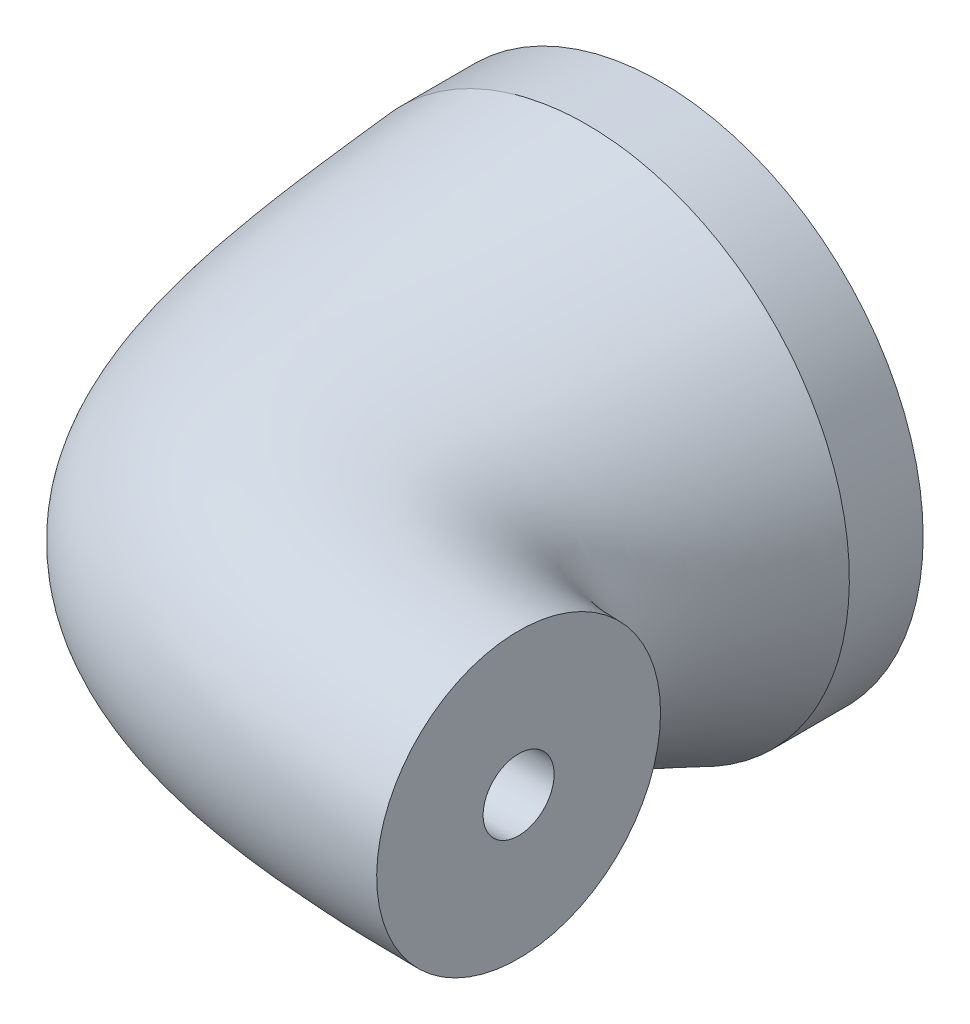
ISO-10303-21;
HEADER;
FILE_DESCRIPTION(('STEP AP214'),'2;1');
FILE_NAME('part.step','',(''),(''),'','','');
FILE_SCHEMA(('AUTOMOTIVE_DESIGN { 1 0 10303 214 1 1 1 1 }'));
ENDSEC;
DATA;
#1=APPLICATION_CONTEXT('core data for automotive mechanical design processes');
#2=APPLICATION_PROTOCOL_DEFINITION('international standard','automotive_design',2000,#1);
#3=PRODUCT_CONTEXT('',#1,'mechanical');
#4=PRODUCT('Part','Part','',(#3));
#5=PRODUCT_RELATED_PRODUCT_CATEGORY('part','',(#4));
#6=PRODUCT_DEFINITION_FORMATION('','',#4);
#7=PRODUCT_DEFINITION_CONTEXT('part definition',#1,'design');
#8=PRODUCT_DEFINITION('design','',#6,#7);
#9=PRODUCT_DEFINITION_SHAPE('','',#8);
#10=(LENGTH_UNIT() NAMED_UNIT(*) SI_UNIT(.MILLI.,.METRE.));
#11=(NAMED_UNIT(*) PLANE_ANGLE_UNIT() SI_UNIT($,.RADIAN.));
#12=(NAMED_UNIT(*) SI_UNIT($,.STERADIAN.) SOLID_ANGLE_UNIT());
#13=UNCERTAINTY_MEASURE_WITH_UNIT(LENGTH_MEASURE(1.E-05),#10,'distance_accuracy_value','');
#14=(GEOMETRIC_REPRESENTATION_CONTEXT(3) GLOBAL_UNCERTAINTY_ASSIGNED_CONTEXT((#13)) GLOBAL_UNIT_ASSIGNED_CONTEXT((#10,
#11,#12)) REPRESENTATION_CONTEXT('',''));
#15=CARTESIAN_POINT('',(0.,0.,0.));
#16=DIRECTION('',(0.,0.,1.));
#17=DIRECTION('',(1.,0.,0.));
#18=AXIS2_PLACEMENT_3D('',#15,#16,#17);
#19=CARTESIAN_POINT('',(0.,0.,0.));
#20=DIRECTION('',(0.,0.,1.));
#21=DIRECTION('',(1.,0.,0.));
#22=AXIS2_PLACEMENT_3D('',#19,#20,#21);
#23=PLANE('',#22);
#24=CARTESIAN_POINT('',(0.,0.,0.));
#25=DIRECTION('',(0.,0.,1.));
#26=DIRECTION('',(1.,0.,0.));
#27=AXIS2_PLACEMENT_3D('',#24,#25,#26);
#28=CIRCLE('',#27,185.);
#29=CARTESIAN_POINT('',(185.,0.,0.));
#30=VERTEX_POINT('',#29);
#31=EDGE_CURVE('E11',#30,#30,#28,.T.);
#32=ORIENTED_EDGE('',*,*,#31,.F.);
#33=EDGE_LOOP('',(#32));
#34=FACE_BOUND('',#33,.T.);
#35=CARTESIAN_POINT('',(0.,0.,0.));
#36=DIRECTION('',(0.,0.,1.));
#37=DIRECTION('',(1.,0.,0.));
#38=AXIS2_PLACEMENT_3D('',#35,#36,#37);
#39=CIRCLE('',#38,166.);
#40=CARTESIAN_POINT('',(166.,0.,0.));
#41=VERTEX_POINT('',#40);
#42=EDGE_CURVE('E78',#41,#41,#39,.T.);
#43=ORIENTED_EDGE('',*,*,#42,.T.);
#44=EDGE_LOOP('',(#43));
#45=FACE_BOUND('',#44,.T.);
#46=ADVANCED_FACE('F67',(#34,#45),#23,.F.);
#47=CARTESIAN_POINT('',(0.,0.,50.));
#48=DIRECTION('',(0.,0.,-1.));
#49=DIRECTION('',(-1.,0.,0.));
#50=AXIS2_PLACEMENT_3D('',#47,#48,#49);
#51=CYLINDRICAL_SURFACE('',#50,185.);
#52=ORIENTED_EDGE('',*,*,#31,.T.);
#53=EDGE_LOOP('',(#52));
#54=FACE_BOUND('',#53,.T.);
#55=CARTESIAN_POINT('',(-184.889341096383,6.39777687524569,52.));
#56=CARTESIAN_POINT('',(-185.308074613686,-5.70320220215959,52.));
#57=CARTESIAN_POINT('',(-183.762540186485,-29.9876200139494,51.9999999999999));
#58=CARTESIAN_POINT('',(-174.380959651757,-65.2615224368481,52.0000000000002));
#59=CARTESIAN_POINT('',(-158.298533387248,-98.0275061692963,51.9999999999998));
#60=CARTESIAN_POINT('',(-136.13258113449,-127.026475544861,52.0000000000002));
#61=CARTESIAN_POINT('',(-108.735244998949,-151.143824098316,51.9999999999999));
#62=CARTESIAN_POINT('',(-77.159208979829,-169.452841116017,52.0000000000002));
#63=CARTESIAN_POINT('',(-42.6180230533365,-181.249860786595,51.9999999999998));
#64=CARTESIAN_POINT('',(-6.43902823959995,-186.081563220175,52.));
#65=CARTESIAN_POINT('',(29.9874001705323,-183.762247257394,52.));
#66=CARTESIAN_POINT('',(65.2614424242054,-174.381059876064,52.));
#67=CARTESIAN_POINT('',(98.0275048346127,-158.298497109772,51.9999999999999));
#68=CARTESIAN_POINT('',(127.026453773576,-136.132631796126,52.0000000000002));
#69=CARTESIAN_POINT('',(151.143791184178,-108.735240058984,51.9999999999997));
#70=CARTESIAN_POINT('',(169.452887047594,-77.1592671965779,52.0000000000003));
#71=CARTESIAN_POINT('',(181.249830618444,-42.6180078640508,51.9999999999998));
#72=CARTESIAN_POINT('',(186.081580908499,-6.43903227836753,51.9999999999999));
#73=CARTESIAN_POINT('',(183.762215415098,29.9873953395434,52.0000000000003));
#74=CARTESIAN_POINT('',(174.38111160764,65.261484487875,51.9999999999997));
#75=CARTESIAN_POINT('',(158.298460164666,98.02752446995,52.0000000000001));
#76=CARTESIAN_POINT('',(136.13262062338,127.026465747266,52.));
#77=CARTESIAN_POINT('',(108.735223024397,151.143829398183,52.));
#78=CARTESIAN_POINT('',(77.1592216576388,169.452838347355,52.));
#79=CARTESIAN_POINT('',(42.6180148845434,181.24986205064,52.));
#80=CARTESIAN_POINT('',(6.43903508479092,186.08156298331,52.));
#81=CARTESIAN_POINT('',(-29.9874084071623,183.762246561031,52.));
#82=CARTESIAN_POINT('',(-65.2614295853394,174.381061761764,52.));
#83=CARTESIAN_POINT('',(-98.0275271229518,158.298493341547,52.));
#84=CARTESIAN_POINT('',(-127.026413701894,136.132638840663,52.));
#85=CARTESIAN_POINT('',(-151.143865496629,108.735226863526,51.9999999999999));
#86=CARTESIAN_POINT('',(-169.452732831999,77.1592945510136,52.0000000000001));
#87=CARTESIAN_POINT('',(-181.250139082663,42.6182544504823,51.9999999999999));
#88=CARTESIAN_POINT('',(-184.470607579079,18.498755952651,52.));
#89=CARTESIAN_POINT('',(-184.889341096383,6.39777687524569,52.));
#90=B_SPLINE_CURVE_WITH_KNOTS('',3,(#55,#56,#57,#58,#59,#60,#61,#62,#63,#64,#65,#66,#67,#68,#69,
#70,#71,#72,#73,#74,#75,#76,#77,#78,#79,#80,#81,#82,#83,#84,#85,#86,#87,#88,#89),.UNSPECIFIED.,
.T.,.F.,(4,1,1,1,1,1,1,1,1,1,1,1,1,1,1,1,1,1,1,1,1,1,1,1,1,1,1,1,1,1,1,1,4),(0.,0.03125,0.0625,
0.09375,0.125,0.15625,0.1875,0.21875,0.25,0.28125,0.3125,0.34375,0.375,0.40625,0.4375,0.46875,
0.5,0.53125,0.5625,0.59375,0.625,0.65625,0.6875,0.71875,0.75,0.78125,0.8125,0.84375,0.875,
0.90625,0.9375,0.96875,1.),.UNSPECIFIED.);
#91=CARTESIAN_POINT('',(-184.889341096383,6.39777687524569,52.));
#92=VERTEX_POINT('',#91);
#93=EDGE_CURVE('E90',#92,#92,#90,.T.);
#94=ORIENTED_EDGE('',*,*,#93,.F.);
#95=EDGE_LOOP('',(#94));
#96=FACE_BOUND('',#95,.T.);
#97=ADVANCED_FACE('F69',(#54,#96),#51,.T.);
#98=CARTESIAN_POINT('',(0.,0.,50.));
#99=DIRECTION('',(0.,0.,-1.));
#100=DIRECTION('',(-1.,0.,0.));
#101=AXIS2_PLACEMENT_3D('',#98,#99,#100);
#102=CYLINDRICAL_SURFACE('',#101,166.);
#103=CARTESIAN_POINT('',(0.,0.,50.));
#104=DIRECTION('',(0.,0.,1.));
#105=DIRECTION('',(1.,0.,0.));
#106=AXIS2_PLACEMENT_3D('',#103,#104,#105);
#107=CIRCLE('',#106,166.);
#108=CARTESIAN_POINT('',(166.,0.,50.));
#109=VERTEX_POINT('',#108);
#110=EDGE_CURVE('E84',#109,#109,#107,.T.);
#111=ORIENTED_EDGE('',*,*,#110,.T.);
#112=EDGE_LOOP('',(#111));
#113=FACE_BOUND('',#112,.T.);
#114=ORIENTED_EDGE('',*,*,#42,.F.);
#115=EDGE_LOOP('',(#114));
#116=FACE_BOUND('',#115,.T.);
#117=ADVANCED_FACE('F173',(#113,#116),#102,.F.);
#118=CARTESIAN_POINT('',(0.,0.,50.));
#119=DIRECTION('',(0.,0.,1.));
#120=DIRECTION('',(1.,0.,0.));
#121=AXIS2_PLACEMENT_3D('',#118,#119,#120);
#122=PLANE('',#121);
#123=ORIENTED_EDGE('',*,*,#110,.F.);
#124=EDGE_LOOP('',(#123));
#125=FACE_BOUND('',#124,.T.);
#126=ADVANCED_FACE('F129',(#125),#122,.F.);
#127=CARTESIAN_POINT('',(-184.889341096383,6.39777687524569,52.));
#128=CARTESIAN_POINT('',(-186.210499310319,8.92705380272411,225.670797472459));
#129=CARTESIAN_POINT('',(-187.531657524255,11.4563307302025,399.341594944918));
#130=CARTESIAN_POINT('',(200.,11.4563307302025,399.341594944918));
#131=CARTESIAN_POINT('',(-185.308074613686,-5.70320220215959,52.));
#132=CARTESIAN_POINT('',(-186.706652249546,-0.374381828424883,226.045705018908));
#133=CARTESIAN_POINT('',(-188.105229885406,4.95443854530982,400.091410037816));
#134=CARTESIAN_POINT('',(200.,4.95443854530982,400.091410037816));
#135=CARTESIAN_POINT('',(-183.762540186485,-29.9876200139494,51.9999999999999));
#136=CARTESIAN_POINT('',(-185.49901874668,-19.0923105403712,226.155336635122));
#137=CARTESIAN_POINT('',(-187.235497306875,-8.19700106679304,400.310673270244));
#138=CARTESIAN_POINT('',(200.,-8.19700106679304,400.310673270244));
#139=CARTESIAN_POINT('',(-174.380959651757,-65.2615224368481,52.0000000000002));
#140=CARTESIAN_POINT('',(-177.151254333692,-46.4352652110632,224.391911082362));
#141=CARTESIAN_POINT('',(-179.921549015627,-27.6090079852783,396.783822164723));
#142=CARTESIAN_POINT('',(200.,-27.6090079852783,396.783822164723));
#143=CARTESIAN_POINT('',(-158.298533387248,-98.0275061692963,51.9999999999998));
#144=CARTESIAN_POINT('',(-162.590753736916,-71.9937866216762,220.769022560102));
#145=CARTESIAN_POINT('',(-166.882974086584,-45.9600670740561,389.538045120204));
#146=CARTESIAN_POINT('',(200.,-45.9600670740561,389.538045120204));
#147=CARTESIAN_POINT('',(-136.13258113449,-127.026475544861,52.0000000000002));
#148=CARTESIAN_POINT('',(-142.377866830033,-94.7857256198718,215.425575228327));
#149=CARTESIAN_POINT('',(-148.623152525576,-62.5449756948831,378.851150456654));
#150=CARTESIAN_POINT('',(200.,-62.5449756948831,378.851150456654));
#151=CARTESIAN_POINT('',(-108.735244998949,-151.143824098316,51.9999999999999));
#152=CARTESIAN_POINT('',(-117.293654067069,-113.935061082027,208.567082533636));
#153=CARTESIAN_POINT('',(-125.852063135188,-76.7262980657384,365.134165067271));
#154=CARTESIAN_POINT('',(200.,-76.7262980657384,365.134165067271));
#155=CARTESIAN_POINT('',(-77.159208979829,-169.452841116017,52.0000000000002));
#156=CARTESIAN_POINT('',(-88.3083877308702,-128.705949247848,200.457019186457));
#157=CARTESIAN_POINT('',(-99.4575664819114,-87.9590573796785,348.914038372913));
#158=CARTESIAN_POINT('',(200.,-87.9590573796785,348.914038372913));
#159=CARTESIAN_POINT('',(-42.6180230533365,-181.249860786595,51.9999999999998));
#160=CARTESIAN_POINT('',(-56.5455798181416,-138.530751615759,191.407095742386));
#161=CARTESIAN_POINT('',(-70.4731365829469,-95.8116424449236,330.814191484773));
#162=CARTESIAN_POINT('',(199.999999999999,-95.8116424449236,330.814191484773));
#163=CARTESIAN_POINT('',(-6.43902823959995,-186.081563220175,52.));
#164=CARTESIAN_POINT('',(-23.2389966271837,-143.031866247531,181.765100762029));
#165=CARTESIAN_POINT('',(-40.0389650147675,-99.9821692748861,311.530201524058));
#166=CARTESIAN_POINT('',(200.000000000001,-99.9821692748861,311.530201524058));
#167=CARTESIAN_POINT('',(29.9874001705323,-183.762247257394,52.));
#168=CARTESIAN_POINT('',(10.3140574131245,-142.036373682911,171.901564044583));
#169=CARTESIAN_POINT('',(-9.35928534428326,-100.310500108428,291.803128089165));
#170=CARTESIAN_POINT('',(199.999999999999,-100.310500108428,291.803128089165));
#171=CARTESIAN_POINT('',(65.2614424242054,-174.381059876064,52.));
#172=CARTESIAN_POINT('',(42.8027491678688,-135.582476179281,162.195494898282));
#173=CARTESIAN_POINT('',(20.3440559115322,-96.7838924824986,272.390989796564));
#174=CARTESIAN_POINT('',(200.000000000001,-96.7838924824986,272.390989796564));
#175=CARTESIAN_POINT('',(98.0275048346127,-158.298497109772,51.9999999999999));
#176=CARTESIAN_POINT('',(72.9545909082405,-123.918240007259,153.019939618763));
#177=CARTESIAN_POINT('',(47.8816769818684,-89.5379829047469,254.039879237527));
#178=CARTESIAN_POINT('',(199.999999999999,-89.5379829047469,254.039879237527));
#179=CARTESIAN_POINT('',(127.026453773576,-136.132631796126,52.0000000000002));
#180=CARTESIAN_POINT('',(99.5894823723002,-107.491886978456,144.727494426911));
#181=CARTESIAN_POINT('',(72.1525109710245,-78.8511421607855,237.454988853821));
#182=CARTESIAN_POINT('',(200.000000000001,-78.8511421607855,237.454988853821));
#183=CARTESIAN_POINT('',(151.143791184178,-108.735240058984,51.9999999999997));
#184=CARTESIAN_POINT('',(121.675527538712,-86.934678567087,137.636837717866));
#185=CARTESIAN_POINT('',(92.2072638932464,-65.1341170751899,223.273675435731));
#186=CARTESIAN_POINT('',(199.999999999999,-65.1341170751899,223.273675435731));
#187=CARTESIAN_POINT('',(169.452887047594,-77.1592671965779,52.0000000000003));
#188=CARTESIAN_POINT('',(138.3849563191,-63.03664317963,132.02046026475));
#189=CARTESIAN_POINT('',(107.317025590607,-48.9140191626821,212.0409205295));
#190=CARTESIAN_POINT('',(200.,-48.9140191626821,212.0409205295));
#191=CARTESIAN_POINT('',(181.249830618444,-42.6180078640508,51.9999999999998));
#192=CARTESIAN_POINT('',(149.137513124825,-36.7161016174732,128.0941866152));
#193=CARTESIAN_POINT('',(117.025195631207,-30.8141953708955,204.188373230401));
#194=CARTESIAN_POINT('',(200.,-30.8141953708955,204.188373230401));
#195=CARTESIAN_POINT('',(186.081580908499,-6.43903227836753,51.9999999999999));
#196=CARTESIAN_POINT('',(153.611567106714,-8.98461783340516,126.008915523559));
#197=CARTESIAN_POINT('',(121.141553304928,-11.5302033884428,200.017831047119));
#198=CARTESIAN_POINT('',(199.999999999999,-11.5302033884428,200.017831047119));
#199=CARTESIAN_POINT('',(183.762215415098,29.9873953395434,52.0000000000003));
#200=CARTESIAN_POINT('',(151.710481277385,19.0921396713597,125.844757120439));
#201=CARTESIAN_POINT('',(119.658747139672,8.19688400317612,199.689514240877));
#202=CARTESIAN_POINT('',(200.000000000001,8.19688400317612,199.689514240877));
#203=CARTESIAN_POINT('',(174.38111160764,65.261484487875,51.9999999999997));
#204=CARTESIAN_POINT('',(143.519611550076,46.4352311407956,127.608044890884));
#205=CARTESIAN_POINT('',(112.658111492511,27.6089777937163,203.216089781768));
#206=CARTESIAN_POINT('',(199.999999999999,27.6089777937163,203.216089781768));
#207=CARTESIAN_POINT('',(158.298460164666,98.02752446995,52.0000000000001));
#208=CARTESIAN_POINT('',(129.298713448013,71.9938041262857,131.231001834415));
#209=CARTESIAN_POINT('',(100.298966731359,45.9600837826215,210.46200366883));
#210=CARTESIAN_POINT('',(200.000000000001,45.9600837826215,210.46200366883));
#211=CARTESIAN_POINT('',(136.13262062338,127.026465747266,52.));
#212=CARTESIAN_POINT('',(109.512901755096,94.7857160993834,136.574411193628));
#213=CARTESIAN_POINT('',(82.8931828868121,62.5449664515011,221.148822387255));
#214=CARTESIAN_POINT('',(200.,62.5449664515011,221.148822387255));
#215=CARTESIAN_POINT('',(108.735223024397,151.143829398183,52.));
#216=CARTESIAN_POINT('',(84.8562452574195,113.935066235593,143.432924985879));
#217=CARTESIAN_POINT('',(60.9772674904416,76.7263030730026,234.865849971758));
#218=CARTESIAN_POINT('',(200.,76.7263030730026,234.865849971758));
#219=CARTESIAN_POINT('',(77.1592216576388,169.452838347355,52.));
#220=CARTESIAN_POINT('',(56.2420810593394,128.705946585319,151.542976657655));
#221=CARTESIAN_POINT('',(35.32494046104,87.9590548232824,251.085953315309));
#222=CARTESIAN_POINT('',(200.,87.9590548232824,251.085953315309));
#223=CARTESIAN_POINT('',(42.6180148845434,181.24986205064,52.));
#224=CARTESIAN_POINT('',(24.7629068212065,138.530752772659,160.592906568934));
#225=CARTESIAN_POINT('',(6.90779875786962,95.8116434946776,269.185813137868));
#226=CARTESIAN_POINT('',(199.999999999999,95.8116434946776,269.185813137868));
#227=CARTESIAN_POINT('',(6.43903508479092,186.08156298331,52.));
#228=CARTESIAN_POINT('',(-8.36262534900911,143.031865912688,170.234897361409));
#229=CARTESIAN_POINT('',(-23.1642857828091,99.9821688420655,288.469794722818));
#230=CARTESIAN_POINT('',(200.000000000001,99.9821688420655,288.469794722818));
#231=CARTESIAN_POINT('',(-29.9874084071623,183.762246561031,52.));
#232=CARTESIAN_POINT('',(-41.8458111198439,142.036373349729,180.098438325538));
#233=CARTESIAN_POINT('',(-53.7042138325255,100.310500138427,308.196876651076));
#234=CARTESIAN_POINT('',(199.999999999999,100.310500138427,308.196876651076));
#235=CARTESIAN_POINT('',(-65.2614295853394,174.381061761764,52.));
#236=CARTESIAN_POINT('',(-74.3827559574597,135.582477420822,189.804500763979));
#237=CARTESIAN_POINT('',(-83.5040823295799,96.7838930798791,327.609001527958));
#238=CARTESIAN_POINT('',(200.000000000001,96.7838930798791,327.609001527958));
#239=CARTESIAN_POINT('',(-98.0275271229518,158.298493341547,52.));
#240=CARTESIAN_POINT('',(-104.707176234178,123.918237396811,198.980068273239));
#241=CARTESIAN_POINT('',(-111.386825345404,89.5379814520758,345.960136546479));
#242=CARTESIAN_POINT('',(199.999999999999,89.5379814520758,345.960136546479));
#243=CARTESIAN_POINT('',(-127.026413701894,136.132638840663,52.));
#244=CARTESIAN_POINT('',(-131.639867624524,107.49189191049,207.27249129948));
#245=CARTESIAN_POINT('',(-136.253321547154,78.8511449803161,362.54498259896));
#246=CARTESIAN_POINT('',(200.000000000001,78.8511449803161,362.544982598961));
#247=CARTESIAN_POINT('',(-151.143865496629,108.735226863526,51.9999999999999));
#248=CARTESIAN_POINT('',(-154.134640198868,86.9346693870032,214.363187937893));
#249=CARTESIAN_POINT('',(-157.125414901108,65.1341119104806,376.726375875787));
#250=CARTESIAN_POINT('',(199.999999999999,65.1341119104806,376.726375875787));
#251=CARTESIAN_POINT('',(-169.452732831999,77.1592945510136,52.0000000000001));
#252=CARTESIAN_POINT('',(-171.317587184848,63.0366615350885,219.979493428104));
#253=CARTESIAN_POINT('',(-173.182441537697,48.9140285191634,387.958986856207));
#254=CARTESIAN_POINT('',(200.000000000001,48.9140285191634,387.958986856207));
#255=CARTESIAN_POINT('',(-181.250139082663,42.6182544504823,51.9999999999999));
#256=CARTESIAN_POINT('',(-182.522101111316,36.7163032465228,223.905891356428));
#257=CARTESIAN_POINT('',(-183.794063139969,30.8143520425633,395.811782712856));
#258=CARTESIAN_POINT('',(200.,30.8143520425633,395.811782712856));
#259=CARTESIAN_POINT('',(-184.470607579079,18.498755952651,52.));
#260=CARTESIAN_POINT('',(-185.714346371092,18.2284894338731,225.29588992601));
#261=CARTESIAN_POINT('',(-186.958085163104,17.9582229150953,398.59177985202));
#262=CARTESIAN_POINT('',(200.,17.9582229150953,398.59177985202));
#263=CARTESIAN_POINT('',(-184.889341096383,6.39777687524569,52.));
#264=CARTESIAN_POINT('',(-186.210499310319,8.92705380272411,225.670797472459));
#265=CARTESIAN_POINT('',(-187.531657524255,11.4563307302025,399.341594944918));
#266=CARTESIAN_POINT('',(200.,11.4563307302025,399.341594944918));
#267=B_SPLINE_SURFACE_WITH_KNOTS('',3,3,((#127,#128,#129,#130),(#131,#132,#133,#134),(#135,#136,
#137,#138),(#139,#140,#141,#142),(#143,#144,#145,#146),(#147,#148,#149,#150),(#151,#152,#153,
#154),(#155,#156,#157,#158),(#159,#160,#161,#162),(#163,#164,#165,#166),(#167,#168,#169,#170),
(#171,#172,#173,#174),(#175,#176,#177,#178),(#179,#180,#181,#182),(#183,#184,#185,#186),(#187,
#188,#189,#190),(#191,#192,#193,#194),(#195,#196,#197,#198),(#199,#200,#201,#202),(#203,#204,
#205,#206),(#207,#208,#209,#210),(#211,#212,#213,#214),(#215,#216,#217,#218),(#219,#220,#221,
#222),(#223,#224,#225,#226),(#227,#228,#229,#230),(#231,#232,#233,#234),(#235,#236,#237,#238),
(#239,#240,#241,#242),(#243,#244,#245,#246),(#247,#248,#249,#250),(#251,#252,#253,#254),(#255,
#256,#257,#258),(#259,#260,#261,#262),(#263,#264,#265,#266)),.UNSPECIFIED.,.T.,.F.,.F.,(4,1,1,1,
1,1,1,1,1,1,1,1,1,1,1,1,1,1,1,1,1,1,1,1,1,1,1,1,1,1,1,1,4),(4,4),(0.,0.03125,0.0625,0.09375,
0.125,0.15625,0.1875,0.21875,0.25,0.28125,0.3125,0.34375,0.375,0.40625,0.4375,0.46875,0.5,
0.53125,0.5625,0.59375,0.625,0.65625,0.6875,0.71875,0.75,0.78125,0.8125,0.84375,0.875,0.90625,
0.9375,0.96875,1.),(0.,1.),.UNSPECIFIED.);
#268=CARTESIAN_POINT('',(200.,0.,300.));
#269=DIRECTION('',(1.,0.,0.));
#270=DIRECTION('',(0.,0.,-1.));
#271=AXIS2_PLACEMENT_3D('',#268,#269,#270);
#272=CIRCLE('',#271,100.);
#273=CARTESIAN_POINT('',(200.,0.,200.));
#274=VERTEX_POINT('',#273);
#275=EDGE_CURVE('E94',#274,#274,#272,.T.);
#276=ORIENTED_EDGE('',*,*,#93,.T.);
#277=EDGE_LOOP('',(#276));
#278=FACE_BOUND('',#277,.T.);
#279=ORIENTED_EDGE('',*,*,#275,.F.);
#280=EDGE_LOOP('',(#279));
#281=FACE_BOUND('',#280,.T.);
#282=ADVANCED_FACE('F116',(#278,#281),#267,.T.);
#283=CARTESIAN_POINT('',(200.,0.,300.));
#284=DIRECTION('',(1.,0.,0.));
#285=DIRECTION('',(0.,0.,-1.));
#286=AXIS2_PLACEMENT_3D('',#283,#284,#285);
#287=PLANE('',#286);
#288=CARTESIAN_POINT('',(200.,0.,300.));
#289=DIRECTION('',(1.,0.,0.));
#290=DIRECTION('',(0.,0.,-1.));
#291=AXIS2_PLACEMENT_3D('',#288,#289,#290);
#292=CIRCLE('',#291,25.);
#293=CARTESIAN_POINT('',(200.,0.,275.));
#294=VERTEX_POINT('',#293);
#295=EDGE_CURVE('E106',#294,#294,#292,.T.);
#296=ORIENTED_EDGE('',*,*,#295,.F.);
#297=EDGE_LOOP('',(#296));
#298=FACE_BOUND('',#297,.T.);
#299=ORIENTED_EDGE('',*,*,#275,.T.);
#300=EDGE_LOOP('',(#299));
#301=FACE_BOUND('',#300,.T.);
#302=ADVANCED_FACE('F128',(#298,#301),#287,.T.);
#303=CARTESIAN_POINT('',(150.,0.,300.));
#304=DIRECTION('',(1.,0.,0.));
#305=DIRECTION('',(0.,0.,-1.));
#306=AXIS2_PLACEMENT_3D('',#303,#304,#305);
#307=CYLINDRICAL_SURFACE('',#306,25.);
#308=CARTESIAN_POINT('',(150.,0.,300.));
#309=DIRECTION('',(1.,0.,0.));
#310=DIRECTION('',(0.,0.,-1.));
#311=AXIS2_PLACEMENT_3D('',#308,#309,#310);
#312=CIRCLE('',#311,25.);
#313=CARTESIAN_POINT('',(150.,0.,275.));
#314=VERTEX_POINT('',#313);
#315=EDGE_CURVE('E99',#314,#314,#312,.T.);
#316=ORIENTED_EDGE('',*,*,#315,.F.);
#317=EDGE_LOOP('',(#316));
#318=FACE_BOUND('',#317,.T.);
#319=ORIENTED_EDGE('',*,*,#295,.T.);
#320=EDGE_LOOP('',(#319));
#321=FACE_BOUND('',#320,.T.);
#322=ADVANCED_FACE('F130',(#318,#321),#307,.F.);
#323=CARTESIAN_POINT('',(150.,0.,300.));
#324=DIRECTION('',(1.,0.,0.));
#325=DIRECTION('',(0.,0.,-1.));
#326=AXIS2_PLACEMENT_3D('',#323,#324,#325);
#327=PLANE('',#326);
#328=ORIENTED_EDGE('',*,*,#315,.T.);
#329=EDGE_LOOP('',(#328));
#330=FACE_BOUND('',#329,.T.);
#331=ADVANCED_FACE('F165',(#330),#327,.T.);
#332=CLOSED_SHELL('',(#46,#97,#117,#126,#282,#302,#322,#331));
#333=MANIFOLD_SOLID_BREP('B2',#332);
#334=ADVANCED_BREP_SHAPE_REPRESENTATION('',(#18,#333),#14);
#335=SHAPE_DEFINITION_REPRESENTATION(#9,#334);
ENDSEC;
END-ISO-10303-21;
